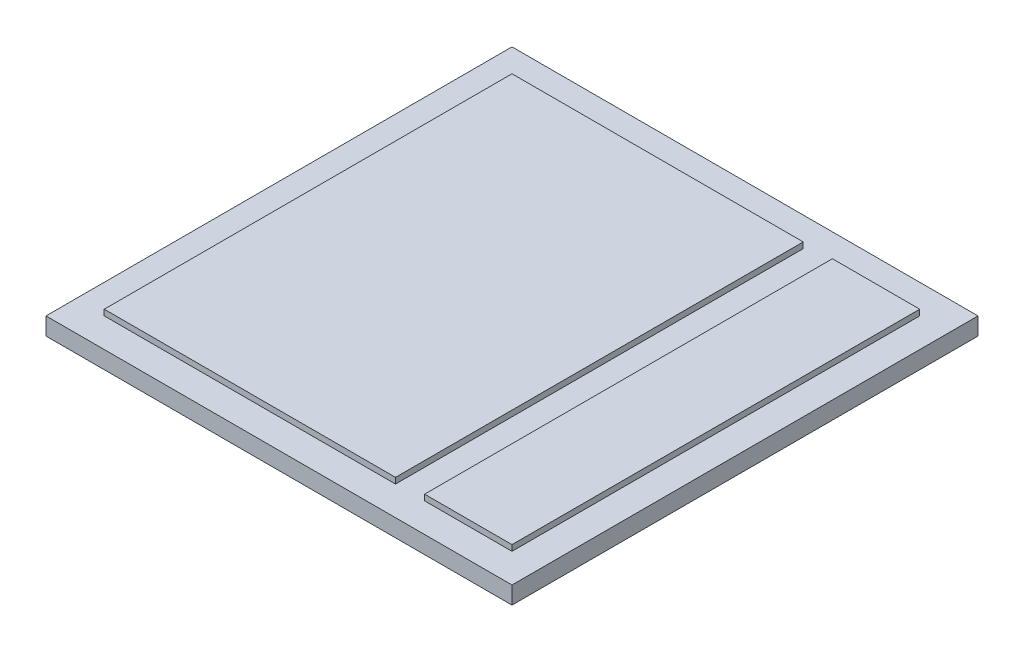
from build123d import *

# Parameters (mm, degrees)
SCHIZZO1_W                   = 80
SCHIZZO1_H                   = 80
ESTRUSIONE_ESTRUSIONE1_DEPTH = 3
SCHIZZO2_W                   = 50
SCHIZZO2_H                   = 70
SCHIZZO2_W_2                 = 15
ESTRUSIONE_ESTRUSIONE2_DEPTH = 1


with BuildPart() as part:
    # Schizzo1 → Estrusione-Estrusione1 (new body)
    with BuildSketch(Plane(origin=(0, 0, 0), x_dir=(1, 0, 0), z_dir=(0, 1, 0))):
        Rectangle(SCHIZZO1_W, SCHIZZO1_H)
    extrude(amount=ESTRUSIONE_ESTRUSIONE1_DEPTH)

    # Schizzo2 → Estrusione-Estrusione2 (add)
    with BuildSketch(Plane(origin=(0, 3, 0), x_dir=(1, 0, 0), z_dir=(0, 1, 0))):
        with Locations((-10, 0)):
            Rectangle(SCHIZZO2_W, SCHIZZO2_H)
        with Locations((27.5, 0)):
            Rectangle(SCHIZZO2_W_2, SCHIZZO2_H)
    extrude(amount=ESTRUSIONE_ESTRUSIONE2_DEPTH)


solid = part.part
